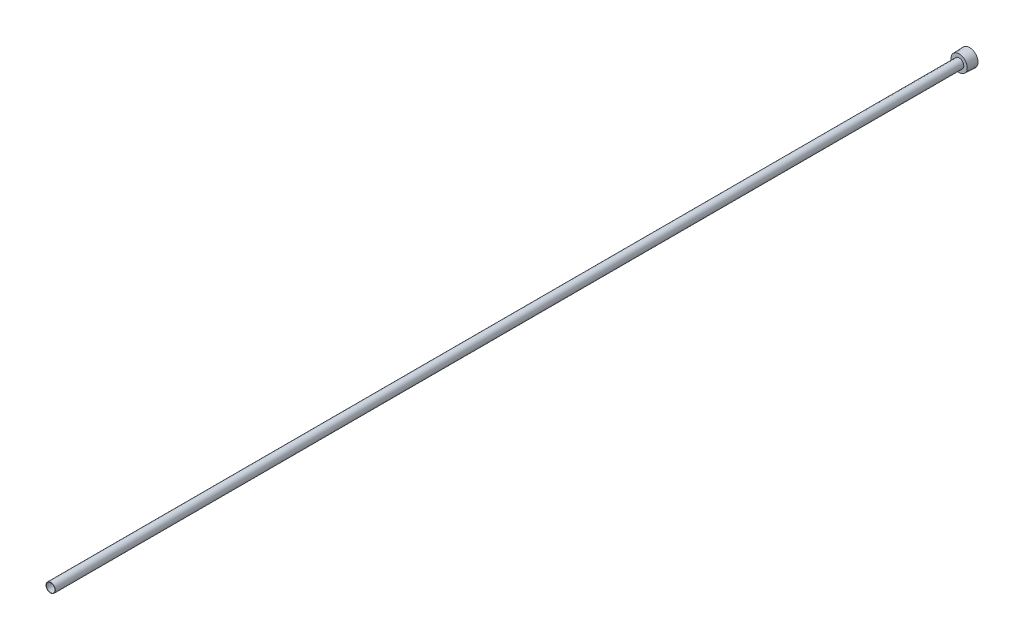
from build123d import *

# Parameters (mm, degrees)
SKETCH2_R          = 4.318
CUT_EXTRUDE1_DEPTH = 915.478470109
CUT_EXTRUDE2_DEPTH = 6.35


with BuildPart() as part:
    # Sketch1 → Revolve1 (revolve)
    with BuildSketch(Plane(origin=(0, 0, 0), x_dir=(0, 0, -1), z_dir=(1, 0, 0)), mode=Mode.PRIVATE) as revolve1_sk:
        Polygon((0, 0), (0, 8.4709), (-10.3124, 8.094743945), (-10.3124, 4.6355), (-914.4, 4.6355), (-914.4, 0), align=None)
    revolve(revolve1_sk.sketch.rotate(Axis((0, 0, 168.793426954), (0, 0, -1)), 90), axis=Axis((0, 0, 168.793426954), (0, 0, -1)))

    # Sketch2 → Cut-Extrude1 (cut, through all)
    with BuildSketch(Plane.XY.offset(914.4)):
        Circle(SKETCH2_R)
    extrude(amount=-CUT_EXTRUDE1_DEPTH, mode=Mode.SUBTRACT)

    # Sketch3 → Cut-Extrude2 (cut)
    with BuildSketch(Plane(origin=(0, 0, 0), x_dir=(-1, 0, 0), z_dir=(0, 0, -1))):
        Polygon((4.7625, -2.749630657), (4.7625, 2.749630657), (0, 5.499261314), (-4.7625, 2.749630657), (-4.7625, -2.749630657), (0, -5.499261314), align=None)
    extrude(amount=-CUT_EXTRUDE2_DEPTH, mode=Mode.SUBTRACT)


solid = part.part
